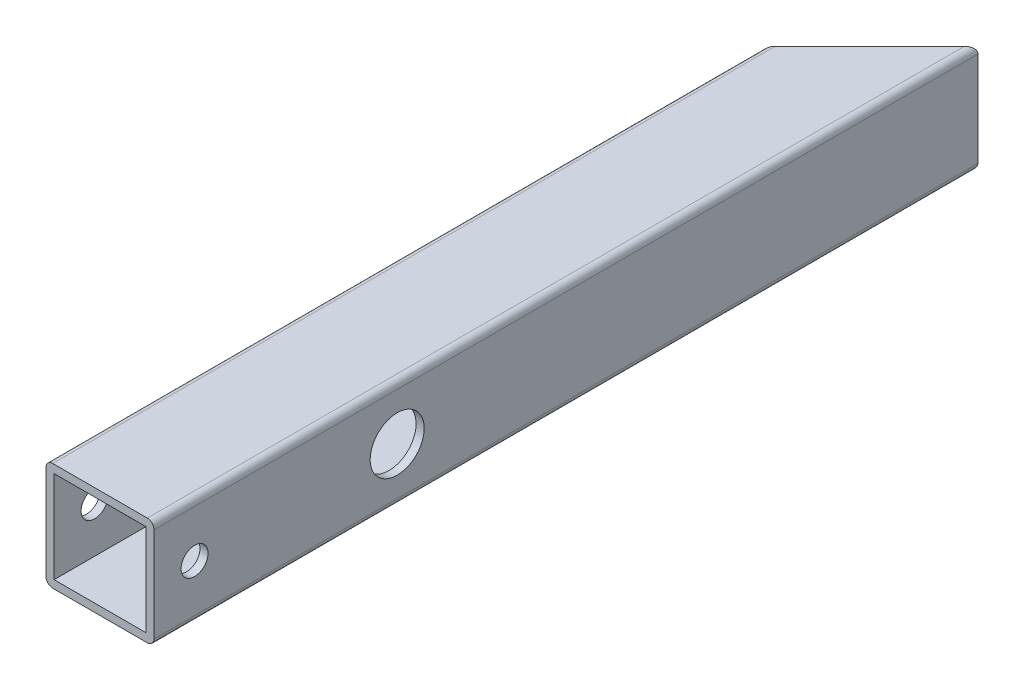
from build123d import *

# Parameters (mm, degrees)
ESQUISSE1_W             = 80
ESQUISSE1_H             = 80
ESQUISSE1_W_2           = 68
ESQUISSE1_H_2           = 68
EXTRU_MINCE1_DEPTH      = 610
ENL_V_MAT_EXTRU_1_DEPTH = 621.40309477
ESQUISSE3_R             = 10
ESQUISSE3_R_2           = 20
ENL_V_MAT_EXTRU_2_DEPTH = 621.40309477
CONG_1_R                = 5


with BuildPart() as part:
    # Esquisse1 → Extru.-Mince1 (new body)
    with BuildSketch(Plane.XY):
        with Locations((40, -40)):
            Rectangle(ESQUISSE1_W, ESQUISSE1_H)
        with Locations((40, -40)):
            Rectangle(ESQUISSE1_W_2, ESQUISSE1_H_2, mode=Mode.SUBTRACT)
    extrude(amount=EXTRU_MINCE1_DEPTH)

    # Esquisse2 → Enl_v. mat.-Extru.1 (cut, through all)
    with BuildSketch(Plane(origin=(0, 0, 0), x_dir=(-1, 0, 0), z_dir=(0, 1, 0))):
        Polygon((-80, 0), (0, 0), (0, 80), align=None)
    extrude(amount=-ENL_V_MAT_EXTRU_1_DEPTH, mode=Mode.SUBTRACT)

    # Esquisse3 → Enl_v. mat.-Extru.2 (cut, through all)
    with BuildSketch(Plane(origin=(80, 0, 0), x_dir=(0, 0, -1), z_dir=(1, 0, 0))):
        with Locations(Location((-580, -40, 0), (0, 0, 90))):
            Circle(ESQUISSE3_R)
        with Locations(Location((-430, -40, 0), (0, 0, 90))):
            Circle(ESQUISSE3_R_2)
    extrude(amount=-ENL_V_MAT_EXTRU_2_DEPTH, mode=Mode.SUBTRACT)

    # Cong_1
    cong_1_edges = [part.edges().sort_by_distance(p)[0] for p in [
        (0, 0, 345),
        (80, 0, 305),
        (80, -80, 305),
        (0, -80, 345),
    ]]
    fillet(cong_1_edges, radius=CONG_1_R)


solid = part.part
